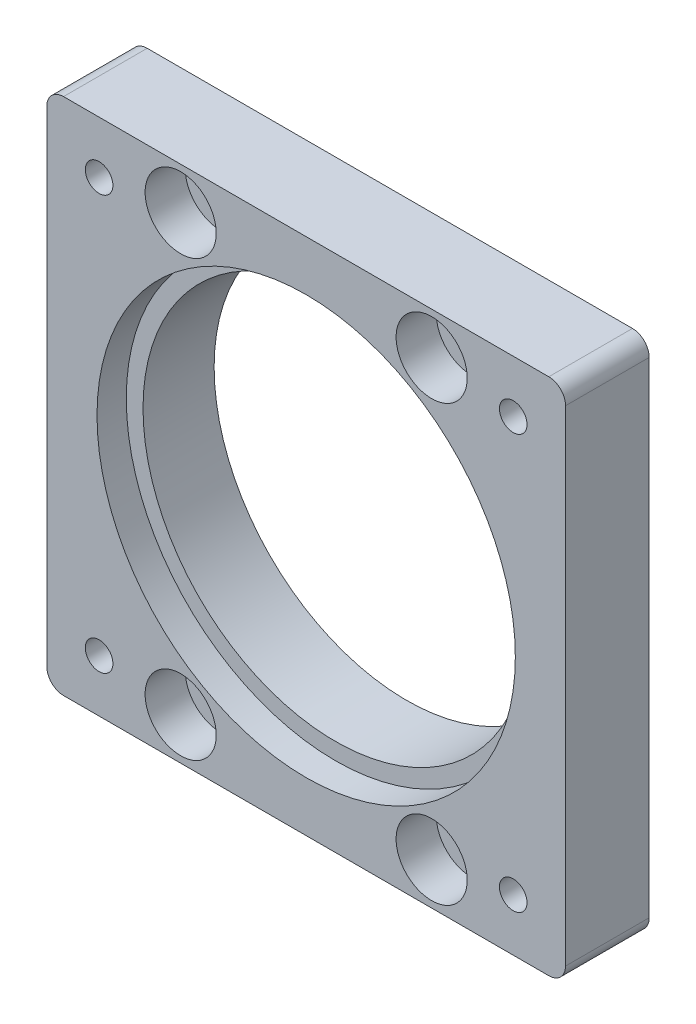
from build123d import *

# Parameters (mm, degrees)
SKETCH_1_W             = 62
SKETCH_1_H             = 62
SKETCH_1_R             = 23
EXTRUDE_1_DEPTH        = 10
SKETCH_2_R             = 1.25
CUT_EXTRUDE_1_DEPTH    = 45.966654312
SKETCH_3_R             = 25
CUT_EXTRUDE_2_DEPTH    = 3.5
SKETCH_5_R             = 2.25
CUT_EXTRUDE_3_DEPTH    = 45.966654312
SKETCH_6_R             = 4.25
CUT_EXTRUDE_4_DEPTH    = 4.8
FILLET_1_R             = 2
SKETCH_7_R             = 25
SKETCH_7_R_2           = 23
EXTRUDE_2_DEPTH        = 2
HOLE_WIZARD_M4_2_D     = 3.3
HOLE_WIZARD_M4_2_DEPTH = 13.4
HOLE_WIZARD_M4_2_TIP   = 0.991420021


with BuildPart() as part:
    # Sketch 1 → Extrude 1 (new body)
    with BuildSketch(Plane.XY):
        Rectangle(SKETCH_1_W, SKETCH_1_H)
        Circle(SKETCH_1_R, mode=Mode.SUBTRACT)
    extrude(amount=EXTRUDE_1_DEPTH)

    # Sketch 2 → Cut-Extrude 1 (cut, through all)
    with BuildSketch(Plane.XY.offset(10)):
        with Locations((-24.748737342, 24.748737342)):
            Circle(SKETCH_2_R)
        with Locations((24.748737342, 24.748737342)):
            Circle(SKETCH_2_R)
        with Locations((24.748737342, -24.748737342)):
            Circle(SKETCH_2_R)
        with Locations((-24.748737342, -24.748737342)):
            Circle(SKETCH_2_R)
    extrude(amount=-CUT_EXTRUDE_1_DEPTH, mode=Mode.SUBTRACT)

    # Sketch 3 → Cut-Extrude 2 (cut)
    with BuildSketch(Plane.XY.offset(10)):
        Circle(SKETCH_3_R)
    extrude(amount=-CUT_EXTRUDE_2_DEPTH, mode=Mode.SUBTRACT)

    # Sketch 5 → Cut-Extrude 3 (cut, through all)
    with BuildSketch(Plane.XY.offset(10)):
        with Locations((-15, 25.980762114)):
            Circle(SKETCH_5_R)
        with Locations((15, 25.980762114)):
            Circle(SKETCH_5_R)
        with Locations((15, -25.980762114)):
            Circle(SKETCH_5_R)
        with Locations((-15, -25.980762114)):
            Circle(SKETCH_5_R)
    extrude(amount=-CUT_EXTRUDE_3_DEPTH, mode=Mode.SUBTRACT)

    # Sketch 6 → Cut-Extrude 4 (cut)
    with BuildSketch(Plane.XY.offset(10)):
        with Locations((-15, 25.980762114)):
            Circle(SKETCH_6_R)
        with Locations((15, 25.980762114)):
            Circle(SKETCH_6_R)
        with Locations((15, -25.980762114)):
            Circle(SKETCH_6_R)
        with Locations((-15, -25.980762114)):
            Circle(SKETCH_6_R)
    extrude(amount=-CUT_EXTRUDE_4_DEPTH, mode=Mode.SUBTRACT)

    # Fillet 1
    fillet_1_edges = [part.edges().sort_by_distance(p)[0] for p in [
        (31, -31, 5),
        (-31, -31, 5),
        (-31, 31, 5),
        (31, 31, 5),
    ]]
    fillet(fillet_1_edges, radius=FILLET_1_R)

    # Sketch 7 → Extrude 2 (add)
    with BuildSketch(Plane(origin=(0, 0, 0), x_dir=(-1, 0, 0), z_dir=(0, 0, -1))):
        with Locations(Location((0, 0, 0), (0, 0, 180))):
            Circle(SKETCH_7_R)
        Circle(SKETCH_7_R_2, mode=Mode.SUBTRACT)
    extrude(amount=EXTRUDE_2_DEPTH)

    # Hole Wizard M4 _2
    with Locations(Plane.XY.offset(10)):
        with Locations((24.748737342, 24.748737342), (24.748737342, -24.748737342), (-24.748737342, 24.748737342), (-24.748737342, -24.748737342)):
            Hole(HOLE_WIZARD_M4_2_D / 2, depth=HOLE_WIZARD_M4_2_DEPTH)
            with Locations((0, 0, -(HOLE_WIZARD_M4_2_DEPTH + HOLE_WIZARD_M4_2_TIP / 2))):  # 118° drill point
                Cone(0, HOLE_WIZARD_M4_2_D / 2, HOLE_WIZARD_M4_2_TIP, mode=Mode.SUBTRACT)


solid = part.part
